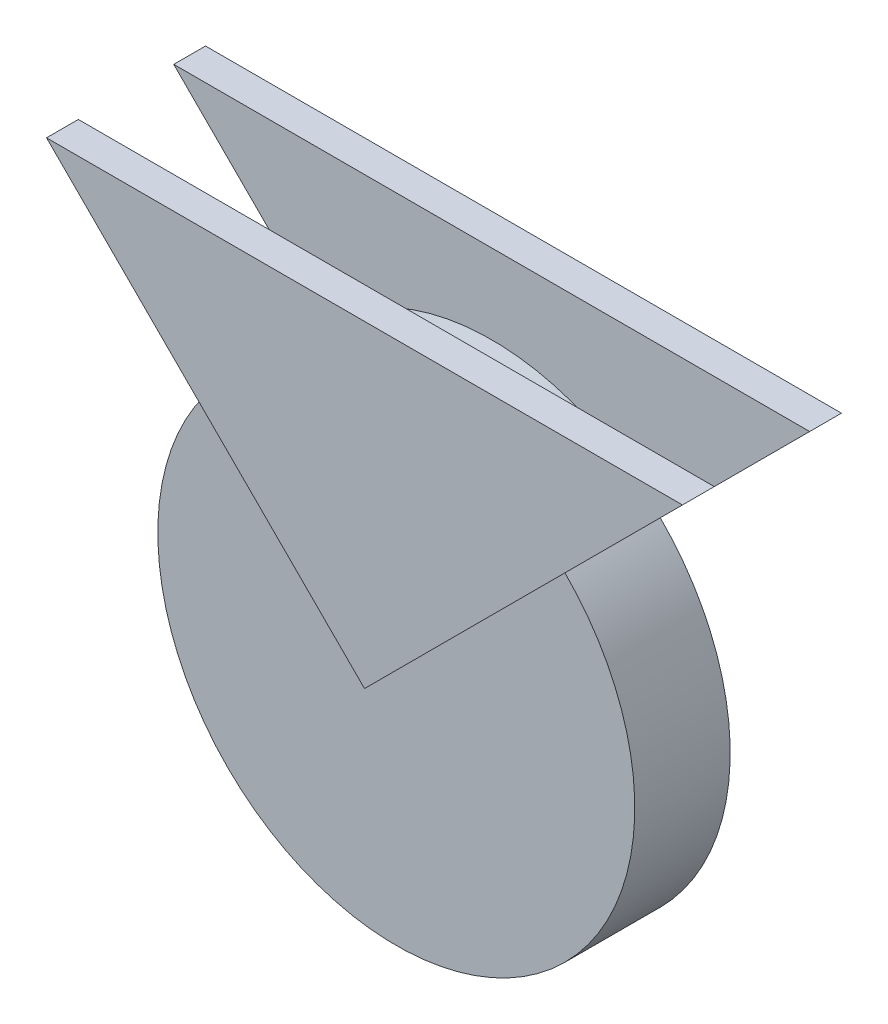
ISO-10303-21;
HEADER;
FILE_DESCRIPTION(('STEP AP214'),'2;1');
FILE_NAME('part.step','',(''),(''),'','','');
FILE_SCHEMA(('AUTOMOTIVE_DESIGN { 1 0 10303 214 1 1 1 1 }'));
ENDSEC;
DATA;
#1=APPLICATION_CONTEXT('core data for automotive mechanical design processes');
#2=APPLICATION_PROTOCOL_DEFINITION('international standard','automotive_design',2000,#1);
#3=PRODUCT_CONTEXT('',#1,'mechanical');
#4=PRODUCT('Part','Part','',(#3));
#5=PRODUCT_RELATED_PRODUCT_CATEGORY('part','',(#4));
#6=PRODUCT_DEFINITION_FORMATION('','',#4);
#7=PRODUCT_DEFINITION_CONTEXT('part definition',#1,'design');
#8=PRODUCT_DEFINITION('design','',#6,#7);
#9=PRODUCT_DEFINITION_SHAPE('','',#8);
#10=(LENGTH_UNIT() NAMED_UNIT(*) SI_UNIT(.MILLI.,.METRE.));
#11=(NAMED_UNIT(*) PLANE_ANGLE_UNIT() SI_UNIT($,.RADIAN.));
#12=(NAMED_UNIT(*) SI_UNIT($,.STERADIAN.) SOLID_ANGLE_UNIT());
#13=UNCERTAINTY_MEASURE_WITH_UNIT(LENGTH_MEASURE(1.E-05),#10,'distance_accuracy_value','');
#14=(GEOMETRIC_REPRESENTATION_CONTEXT(3) GLOBAL_UNCERTAINTY_ASSIGNED_CONTEXT((#13)) GLOBAL_UNIT_ASSIGNED_CONTEXT((#10,
#11,#12)) REPRESENTATION_CONTEXT('',''));
#15=CARTESIAN_POINT('',(0.,0.,0.));
#16=DIRECTION('',(0.,0.,1.));
#17=DIRECTION('',(1.,0.,0.));
#18=AXIS2_PLACEMENT_3D('',#15,#16,#17);
#19=CARTESIAN_POINT('',(0.,0.,0.));
#20=DIRECTION('',(0.,0.,1.));
#21=DIRECTION('',(1.,0.,0.));
#22=AXIS2_PLACEMENT_3D('',#19,#20,#21);
#23=PLANE('',#22);
#24=DIRECTION('',(-0.707106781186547,0.707106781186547,0.));
#25=VECTOR('',#24,1.);
#26=CARTESIAN_POINT('',(0.,0.,0.));
#27=LINE('',#26,#25);
#28=CARTESIAN_POINT('',(0.,0.,0.));
#29=VERTEX_POINT('',#28);
#30=CARTESIAN_POINT('',(-53.033008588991,53.033008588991,0.));
#31=VERTEX_POINT('',#30);
#32=EDGE_CURVE('E126',#29,#31,#27,.T.);
#33=ORIENTED_EDGE('',*,*,#32,.F.);
#34=DIRECTION('',(0.707106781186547,0.707106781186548,0.));
#35=VECTOR('',#34,1.);
#36=CARTESIAN_POINT('',(0.,0.,0.));
#37=LINE('',#36,#35);
#38=CARTESIAN_POINT('',(53.0330085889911,53.0330085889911,0.));
#39=VERTEX_POINT('',#38);
#40=EDGE_CURVE('E105',#29,#39,#37,.T.);
#41=ORIENTED_EDGE('',*,*,#40,.T.);
#42=CARTESIAN_POINT('',(0.,0.,0.));
#43=DIRECTION('',(0.,0.,1.));
#44=DIRECTION('',(1.,0.,0.));
#45=AXIS2_PLACEMENT_3D('',#42,#43,#44);
#46=CIRCLE('',#45,75.);
#47=EDGE_CURVE('E153',#31,#39,#46,.T.);
#48=ORIENTED_EDGE('',*,*,#47,.F.);
#49=EDGE_LOOP('',(#33,#41,#48));
#50=FACE_BOUND('',#49,.T.);
#51=ADVANCED_FACE('F33',(#50),#23,.F.);
#52=CARTESIAN_POINT('',(0.,0.,30.));
#53=DIRECTION('',(0.,0.,1.));
#54=DIRECTION('',(1.,0.,0.));
#55=AXIS2_PLACEMENT_3D('',#52,#53,#54);
#56=PLANE('',#55);
#57=DIRECTION('',(0.707106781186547,0.707106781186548,0.));
#58=VECTOR('',#57,1.);
#59=CARTESIAN_POINT('',(0.,0.,30.));
#60=LINE('',#59,#58);
#61=CARTESIAN_POINT('',(0.,0.,30.));
#62=VERTEX_POINT('',#61);
#63=CARTESIAN_POINT('',(53.0330085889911,53.0330085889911,30.));
#64=VERTEX_POINT('',#63);
#65=EDGE_CURVE('E57',#62,#64,#60,.T.);
#66=ORIENTED_EDGE('',*,*,#65,.F.);
#67=DIRECTION('',(-0.707106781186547,0.707106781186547,0.));
#68=VECTOR('',#67,1.);
#69=CARTESIAN_POINT('',(0.,0.,30.));
#70=LINE('',#69,#68);
#71=CARTESIAN_POINT('',(-53.0330085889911,53.0330085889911,30.));
#72=VERTEX_POINT('',#71);
#73=EDGE_CURVE('E144',#62,#72,#70,.T.);
#74=ORIENTED_EDGE('',*,*,#73,.T.);
#75=CARTESIAN_POINT('',(0.,0.,30.));
#76=DIRECTION('',(0.,0.,1.));
#77=DIRECTION('',(1.,0.,0.));
#78=AXIS2_PLACEMENT_3D('',#75,#76,#77);
#79=CIRCLE('',#78,75.);
#80=EDGE_CURVE('E42',#72,#64,#79,.T.);
#81=ORIENTED_EDGE('',*,*,#80,.T.);
#82=EDGE_LOOP('',(#66,#74,#81));
#83=FACE_BOUND('',#82,.T.);
#84=ADVANCED_FACE('F174',(#83),#56,.T.);
#85=CARTESIAN_POINT('',(0.,0.,30.));
#86=DIRECTION('',(0.,0.,-1.));
#87=DIRECTION('',(-1.,0.,0.));
#88=AXIS2_PLACEMENT_3D('',#85,#86,#87);
#89=CYLINDRICAL_SURFACE('',#88,75.);
#90=EDGE_CURVE('E11',#64,#72,#79,.T.);
#91=ORIENTED_EDGE('',*,*,#90,.F.);
#92=ORIENTED_EDGE('',*,*,#80,.F.);
#93=EDGE_LOOP('',(#91,#92));
#94=FACE_BOUND('',#93,.T.);
#95=EDGE_CURVE('E37',#39,#31,#46,.T.);
#96=ORIENTED_EDGE('',*,*,#95,.T.);
#97=ORIENTED_EDGE('',*,*,#47,.T.);
#98=EDGE_LOOP('',(#96,#97));
#99=FACE_BOUND('',#98,.T.);
#100=ADVANCED_FACE('F35',(#94,#99),#89,.T.);
#101=CARTESIAN_POINT('',(0.,0.,40.));
#102=DIRECTION('',(-0.707106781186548,-0.707106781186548,0.));
#103=DIRECTION('',(0.707106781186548,-0.707106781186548,0.));
#104=AXIS2_PLACEMENT_3D('',#101,#102,#103);
#105=PLANE('',#104);
#106=ORIENTED_EDGE('',*,*,#73,.F.);
#107=DIRECTION('',(0.,0.,-1.));
#108=VECTOR('',#107,1.);
#109=CARTESIAN_POINT('',(0.,0.,40.));
#110=LINE('',#109,#108);
#111=CARTESIAN_POINT('',(0.,0.,40.));
#112=VERTEX_POINT('',#111);
#113=EDGE_CURVE('E151',#112,#62,#110,.T.);
#114=ORIENTED_EDGE('',*,*,#113,.F.);
#115=DIRECTION('',(-0.707106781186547,0.707106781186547,0.));
#116=VECTOR('',#115,1.);
#117=CARTESIAN_POINT('',(0.,0.,40.));
#118=LINE('',#117,#116);
#119=CARTESIAN_POINT('',(-100.,100.,40.));
#120=VERTEX_POINT('',#119);
#121=EDGE_CURVE('E135',#112,#120,#118,.T.);
#122=ORIENTED_EDGE('',*,*,#121,.T.);
#123=DIRECTION('',(0.,0.,-1.));
#124=VECTOR('',#123,1.);
#125=CARTESIAN_POINT('',(-100.,100.,40.));
#126=LINE('',#125,#124);
#127=CARTESIAN_POINT('',(-100.,100.,30.));
#128=VERTEX_POINT('',#127);
#129=EDGE_CURVE('E143',#120,#128,#126,.T.);
#130=ORIENTED_EDGE('',*,*,#129,.T.);
#131=EDGE_CURVE('E133',#72,#128,#70,.T.);
#132=ORIENTED_EDGE('',*,*,#131,.F.);
#133=EDGE_LOOP('',(#106,#114,#122,#130,#132));
#134=FACE_BOUND('',#133,.T.);
#135=ADVANCED_FACE('F162',(#134),#105,.T.);
#136=CARTESIAN_POINT('',(0.,0.,40.));
#137=DIRECTION('',(-0.707106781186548,0.707106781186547,0.));
#138=DIRECTION('',(-0.707106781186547,-0.707106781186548,0.));
#139=AXIS2_PLACEMENT_3D('',#136,#137,#138);
#140=PLANE('',#139);
#141=ORIENTED_EDGE('',*,*,#65,.T.);
#142=CARTESIAN_POINT('',(100.,100.,30.));
#143=VERTEX_POINT('',#142);
#144=EDGE_CURVE('E149',#64,#143,#60,.T.);
#145=ORIENTED_EDGE('',*,*,#144,.T.);
#146=DIRECTION('',(0.,0.,-1.));
#147=VECTOR('',#146,1.);
#148=CARTESIAN_POINT('',(100.,100.,40.));
#149=LINE('',#148,#147);
#150=CARTESIAN_POINT('',(100.,100.,40.));
#151=VERTEX_POINT('',#150);
#152=EDGE_CURVE('E154',#151,#143,#149,.T.);
#153=ORIENTED_EDGE('',*,*,#152,.F.);
#154=DIRECTION('',(0.707106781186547,0.707106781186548,0.));
#155=VECTOR('',#154,1.);
#156=CARTESIAN_POINT('',(0.,0.,40.));
#157=LINE('',#156,#155);
#158=EDGE_CURVE('E141',#112,#151,#157,.T.);
#159=ORIENTED_EDGE('',*,*,#158,.F.);
#160=ORIENTED_EDGE('',*,*,#113,.T.);
#161=EDGE_LOOP('',(#141,#145,#153,#159,#160));
#162=FACE_BOUND('',#161,.T.);
#163=ADVANCED_FACE('F201',(#162),#140,.F.);
#164=CARTESIAN_POINT('',(-100.,100.,40.));
#165=DIRECTION('',(0.,1.,0.));
#166=DIRECTION('',(-1.,0.,0.));
#167=AXIS2_PLACEMENT_3D('',#164,#165,#166);
#168=PLANE('',#167);
#169=DIRECTION('',(1.,0.,0.));
#170=VECTOR('',#169,1.);
#171=CARTESIAN_POINT('',(-100.,100.,30.));
#172=LINE('',#171,#170);
#173=EDGE_CURVE('E146',#128,#143,#172,.T.);
#174=ORIENTED_EDGE('',*,*,#173,.F.);
#175=ORIENTED_EDGE('',*,*,#129,.F.);
#176=DIRECTION('',(1.,0.,0.));
#177=VECTOR('',#176,1.);
#178=CARTESIAN_POINT('',(-100.,100.,40.));
#179=LINE('',#178,#177);
#180=EDGE_CURVE('E138',#120,#151,#179,.T.);
#181=ORIENTED_EDGE('',*,*,#180,.T.);
#182=ORIENTED_EDGE('',*,*,#152,.T.);
#183=EDGE_LOOP('',(#174,#175,#181,#182));
#184=FACE_BOUND('',#183,.T.);
#185=ADVANCED_FACE('F166',(#184),#168,.T.);
#186=CARTESIAN_POINT('',(0.,0.,40.));
#187=DIRECTION('',(0.,0.,-1.));
#188=DIRECTION('',(-1.,0.,0.));
#189=AXIS2_PLACEMENT_3D('',#186,#187,#188);
#190=PLANE('',#189);
#191=ORIENTED_EDGE('',*,*,#121,.F.);
#192=ORIENTED_EDGE('',*,*,#158,.T.);
#193=ORIENTED_EDGE('',*,*,#180,.F.);
#194=EDGE_LOOP('',(#191,#192,#193));
#195=FACE_BOUND('',#194,.T.);
#196=ADVANCED_FACE('F204',(#195),#190,.F.);
#197=CARTESIAN_POINT('',(0.,0.,30.));
#198=DIRECTION('',(0.,0.,-1.));
#199=DIRECTION('',(-1.,0.,0.));
#200=AXIS2_PLACEMENT_3D('',#197,#198,#199);
#201=PLANE('',#200);
#202=ORIENTED_EDGE('',*,*,#144,.F.);
#203=ORIENTED_EDGE('',*,*,#90,.T.);
#204=ORIENTED_EDGE('',*,*,#131,.T.);
#205=ORIENTED_EDGE('',*,*,#173,.T.);
#206=EDGE_LOOP('',(#202,#203,#204,#205));
#207=FACE_BOUND('',#206,.T.);
#208=ADVANCED_FACE('F170',(#207),#201,.T.);
#209=CARTESIAN_POINT('',(0.,0.,0.));
#210=DIRECTION('',(0.,0.,1.));
#211=DIRECTION('',(-1.,0.,0.));
#212=AXIS2_PLACEMENT_3D('',#209,#210,#211);
#213=PLANE('',#212);
#214=ORIENTED_EDGE('',*,*,#95,.F.);
#215=CARTESIAN_POINT('',(100.,100.,0.));
#216=VERTEX_POINT('',#215);
#217=EDGE_CURVE('E49',#39,#216,#37,.T.);
#218=ORIENTED_EDGE('',*,*,#217,.T.);
#219=DIRECTION('',(1.,0.,0.));
#220=VECTOR('',#219,1.);
#221=CARTESIAN_POINT('',(-100.,100.,0.));
#222=LINE('',#221,#220);
#223=CARTESIAN_POINT('',(-100.,100.,0.));
#224=VERTEX_POINT('',#223);
#225=EDGE_CURVE('E119',#224,#216,#222,.T.);
#226=ORIENTED_EDGE('',*,*,#225,.F.);
#227=EDGE_CURVE('E128',#31,#224,#27,.T.);
#228=ORIENTED_EDGE('',*,*,#227,.F.);
#229=EDGE_LOOP('',(#214,#218,#226,#228));
#230=FACE_BOUND('',#229,.T.);
#231=ADVANCED_FACE('F181',(#230),#213,.T.);
#232=CARTESIAN_POINT('',(0.,0.,-10.));
#233=DIRECTION('',(0.707106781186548,0.707106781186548,0.));
#234=DIRECTION('',(-0.707106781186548,0.707106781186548,0.));
#235=AXIS2_PLACEMENT_3D('',#232,#233,#234);
#236=PLANE('',#235);
#237=ORIENTED_EDGE('',*,*,#32,.T.);
#238=ORIENTED_EDGE('',*,*,#227,.T.);
#239=DIRECTION('',(0.,0.,1.));
#240=VECTOR('',#239,1.);
#241=CARTESIAN_POINT('',(-100.,100.,-10.));
#242=LINE('',#241,#240);
#243=CARTESIAN_POINT('',(-100.,100.,-10.));
#244=VERTEX_POINT('',#243);
#245=EDGE_CURVE('E117',#244,#224,#242,.T.);
#246=ORIENTED_EDGE('',*,*,#245,.F.);
#247=DIRECTION('',(-0.707106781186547,0.707106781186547,0.));
#248=VECTOR('',#247,1.);
#249=CARTESIAN_POINT('',(0.,0.,-10.));
#250=LINE('',#249,#248);
#251=CARTESIAN_POINT('',(0.,0.,-10.));
#252=VERTEX_POINT('',#251);
#253=EDGE_CURVE('E114',#252,#244,#250,.T.);
#254=ORIENTED_EDGE('',*,*,#253,.F.);
#255=DIRECTION('',(0.,0.,1.));
#256=VECTOR('',#255,1.);
#257=CARTESIAN_POINT('',(0.,0.,-10.));
#258=LINE('',#257,#256);
#259=EDGE_CURVE('E99',#252,#29,#258,.T.);
#260=ORIENTED_EDGE('',*,*,#259,.T.);
#261=EDGE_LOOP('',(#237,#238,#246,#254,#260));
#262=FACE_BOUND('',#261,.T.);
#263=ADVANCED_FACE('F115',(#262),#236,.F.);
#264=CARTESIAN_POINT('',(-100.,100.,-10.));
#265=DIRECTION('',(0.,-1.,0.));
#266=DIRECTION('',(1.,0.,0.));
#267=AXIS2_PLACEMENT_3D('',#264,#265,#266);
#268=PLANE('',#267);
#269=ORIENTED_EDGE('',*,*,#225,.T.);
#270=DIRECTION('',(0.,0.,1.));
#271=VECTOR('',#270,1.);
#272=CARTESIAN_POINT('',(100.,100.,-10.));
#273=LINE('',#272,#271);
#274=CARTESIAN_POINT('',(100.,100.,-10.));
#275=VERTEX_POINT('',#274);
#276=EDGE_CURVE('E109',#275,#216,#273,.T.);
#277=ORIENTED_EDGE('',*,*,#276,.F.);
#278=DIRECTION('',(1.,0.,0.));
#279=VECTOR('',#278,1.);
#280=CARTESIAN_POINT('',(-100.,100.,-10.));
#281=LINE('',#280,#279);
#282=EDGE_CURVE('E110',#244,#275,#281,.T.);
#283=ORIENTED_EDGE('',*,*,#282,.F.);
#284=ORIENTED_EDGE('',*,*,#245,.T.);
#285=EDGE_LOOP('',(#269,#277,#283,#284));
#286=FACE_BOUND('',#285,.T.);
#287=ADVANCED_FACE('F183',(#286),#268,.F.);
#288=CARTESIAN_POINT('',(0.,0.,-10.));
#289=DIRECTION('',(0.707106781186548,-0.707106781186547,0.));
#290=DIRECTION('',(0.707106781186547,0.707106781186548,0.));
#291=AXIS2_PLACEMENT_3D('',#288,#289,#290);
#292=PLANE('',#291);
#293=ORIENTED_EDGE('',*,*,#40,.F.);
#294=ORIENTED_EDGE('',*,*,#259,.F.);
#295=DIRECTION('',(0.707106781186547,0.707106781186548,0.));
#296=VECTOR('',#295,1.);
#297=CARTESIAN_POINT('',(0.,0.,-10.));
#298=LINE('',#297,#296);
#299=EDGE_CURVE('E103',#252,#275,#298,.T.);
#300=ORIENTED_EDGE('',*,*,#299,.T.);
#301=ORIENTED_EDGE('',*,*,#276,.T.);
#302=ORIENTED_EDGE('',*,*,#217,.F.);
#303=EDGE_LOOP('',(#293,#294,#300,#301,#302));
#304=FACE_BOUND('',#303,.T.);
#305=ADVANCED_FACE('F101',(#304),#292,.T.);
#306=CARTESIAN_POINT('',(0.,0.,-10.));
#307=DIRECTION('',(0.,0.,1.));
#308=DIRECTION('',(-1.,0.,0.));
#309=AXIS2_PLACEMENT_3D('',#306,#307,#308);
#310=PLANE('',#309);
#311=ORIENTED_EDGE('',*,*,#253,.T.);
#312=ORIENTED_EDGE('',*,*,#282,.T.);
#313=ORIENTED_EDGE('',*,*,#299,.F.);
#314=EDGE_LOOP('',(#311,#312,#313));
#315=FACE_BOUND('',#314,.T.);
#316=ADVANCED_FACE('F121',(#315),#310,.F.);
#317=CLOSED_SHELL('',(#51,#84,#100,#135,#163,#185,#196,#208,#231,#263,#287,#305,#316));
#318=MANIFOLD_SOLID_BREP('B2',#317);
#319=ADVANCED_BREP_SHAPE_REPRESENTATION('',(#18,#318),#14);
#320=SHAPE_DEFINITION_REPRESENTATION(#9,#319);
ENDSEC;
END-ISO-10303-21;
